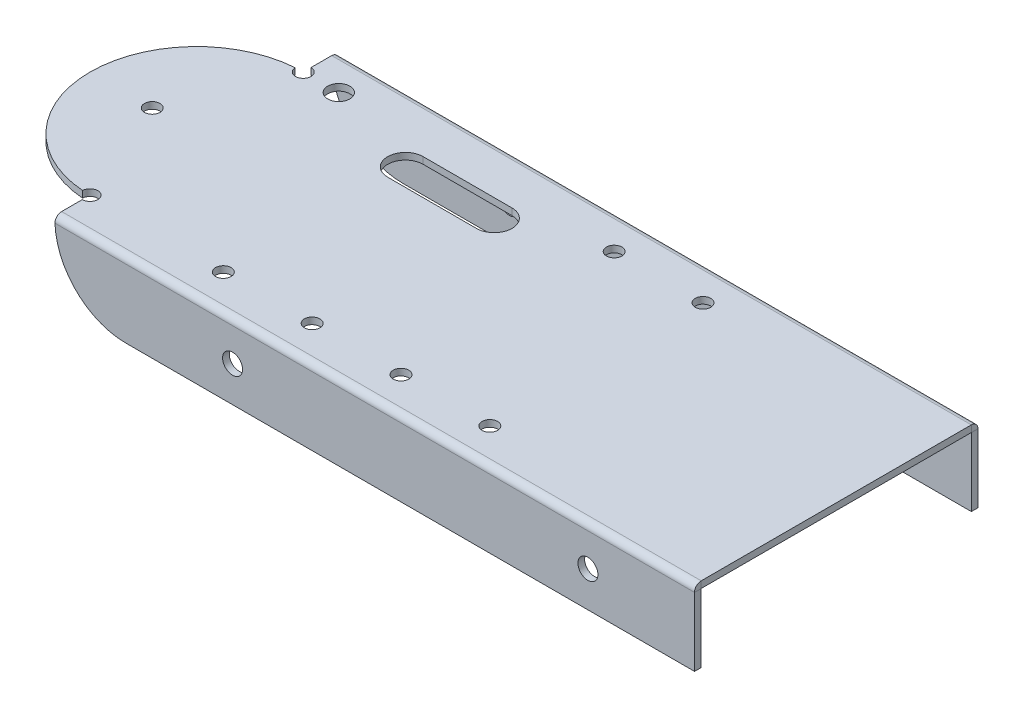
ISO-10303-21;
HEADER;
FILE_DESCRIPTION(('STEP AP214'),'2;1');
FILE_NAME('part.step','',(''),(''),'','','');
FILE_SCHEMA(('AUTOMOTIVE_DESIGN { 1 0 10303 214 1 1 1 1 }'));
ENDSEC;
DATA;
#1=APPLICATION_CONTEXT('core data for automotive mechanical design processes');
#2=APPLICATION_PROTOCOL_DEFINITION('international standard','automotive_design',2000,#1);
#3=PRODUCT_CONTEXT('',#1,'mechanical');
#4=PRODUCT('Part','Part','',(#3));
#5=PRODUCT_RELATED_PRODUCT_CATEGORY('part','',(#4));
#6=PRODUCT_DEFINITION_FORMATION('','',#4);
#7=PRODUCT_DEFINITION_CONTEXT('part definition',#1,'design');
#8=PRODUCT_DEFINITION('design','',#6,#7);
#9=PRODUCT_DEFINITION_SHAPE('','',#8);
#10=(LENGTH_UNIT() NAMED_UNIT(*) SI_UNIT(.MILLI.,.METRE.));
#11=(NAMED_UNIT(*) PLANE_ANGLE_UNIT() SI_UNIT($,.RADIAN.));
#12=(NAMED_UNIT(*) SI_UNIT($,.STERADIAN.) SOLID_ANGLE_UNIT());
#13=UNCERTAINTY_MEASURE_WITH_UNIT(LENGTH_MEASURE(1.E-05),#10,'distance_accuracy_value','');
#14=(GEOMETRIC_REPRESENTATION_CONTEXT(3) GLOBAL_UNCERTAINTY_ASSIGNED_CONTEXT((#13)) GLOBAL_UNIT_ASSIGNED_CONTEXT((#10,
#11,#12)) REPRESENTATION_CONTEXT('',''));
#15=CARTESIAN_POINT('',(0.,0.,0.));
#16=DIRECTION('',(0.,0.,1.));
#17=DIRECTION('',(1.,0.,0.));
#18=AXIS2_PLACEMENT_3D('',#15,#16,#17);
#19=CARTESIAN_POINT('',(40.,0.,31.));
#20=DIRECTION('',(0.,-1.,0.));
#21=DIRECTION('',(0.,0.,-1.));
#22=AXIS2_PLACEMENT_3D('',#19,#20,#21);
#23=PLANE('',#22);
#24=CARTESIAN_POINT('',(74.,0.,24.));
#25=DIRECTION('',(0.,1.,0.));
#26=DIRECTION('',(0.,0.,1.));
#27=AXIS2_PLACEMENT_3D('',#24,#25,#26);
#28=CIRCLE('',#27,1.75);
#29=CARTESIAN_POINT('',(74.,0.,25.75));
#30=VERTEX_POINT('',#29);
#31=EDGE_CURVE('E430',#30,#30,#28,.T.);
#32=ORIENTED_EDGE('',*,*,#31,.T.);
#33=EDGE_LOOP('',(#32));
#34=FACE_BOUND('',#33,.T.);
#35=CARTESIAN_POINT('',(14.,0.,0.));
#36=DIRECTION('',(0.,1.,0.));
#37=DIRECTION('',(0.,0.,1.));
#38=AXIS2_PLACEMENT_3D('',#35,#36,#37);
#39=CIRCLE('',#38,1.75);
#40=CARTESIAN_POINT('',(14.,0.,1.75));
#41=VERTEX_POINT('',#40);
#42=EDGE_CURVE('E442',#41,#41,#39,.T.);
#43=ORIENTED_EDGE('',*,*,#42,.T.);
#44=EDGE_LOOP('',(#43));
#45=FACE_BOUND('',#44,.T.);
#46=CARTESIAN_POINT('',(94.,0.,-24.));
#47=DIRECTION('',(0.,1.,0.));
#48=DIRECTION('',(0.,0.,1.));
#49=AXIS2_PLACEMENT_3D('',#46,#47,#48);
#50=CIRCLE('',#49,1.75);
#51=CARTESIAN_POINT('',(94.,0.,-22.25));
#52=VERTEX_POINT('',#51);
#53=EDGE_CURVE('E448',#52,#52,#50,.T.);
#54=ORIENTED_EDGE('',*,*,#53,.T.);
#55=EDGE_LOOP('',(#54));
#56=FACE_BOUND('',#55,.T.);
#57=CARTESIAN_POINT('',(94.,0.,24.));
#58=DIRECTION('',(0.,1.,0.));
#59=DIRECTION('',(0.,0.,-1.));
#60=AXIS2_PLACEMENT_3D('',#57,#58,#59);
#61=CIRCLE('',#60,1.75);
#62=CARTESIAN_POINT('',(94.,0.,22.25));
#63=VERTEX_POINT('',#62);
#64=EDGE_CURVE('E466',#63,#63,#61,.T.);
#65=ORIENTED_EDGE('',*,*,#64,.T.);
#66=EDGE_LOOP('',(#65));
#67=FACE_BOUND('',#66,.T.);
#68=DIRECTION('',(-1.,0.,0.));
#69=VECTOR('',#68,1.);
#70=CARTESIAN_POINT('',(54.,0.,-21.));
#71=LINE('',#70,#69);
#72=CARTESIAN_POINT('',(74.,0.,-21.));
#73=VERTEX_POINT('',#72);
#74=CARTESIAN_POINT('',(54.,0.,-21.));
#75=VERTEX_POINT('',#74);
#76=EDGE_CURVE('E481',#73,#75,#71,.T.);
#77=ORIENTED_EDGE('',*,*,#76,.T.);
#78=CARTESIAN_POINT('',(54.,0.,-17.));
#79=DIRECTION('',(0.,1.,0.));
#80=DIRECTION('',(0.,0.,1.));
#81=AXIS2_PLACEMENT_3D('',#78,#79,#80);
#82=CIRCLE('',#81,4.);
#83=CARTESIAN_POINT('',(54.,0.,-13.));
#84=VERTEX_POINT('',#83);
#85=EDGE_CURVE('E472',#75,#84,#82,.T.);
#86=ORIENTED_EDGE('',*,*,#85,.T.);
#87=DIRECTION('',(1.,0.,0.));
#88=VECTOR('',#87,1.);
#89=CARTESIAN_POINT('',(74.,0.,-13.));
#90=LINE('',#89,#88);
#91=CARTESIAN_POINT('',(74.,0.,-13.));
#92=VERTEX_POINT('',#91);
#93=EDGE_CURVE('E475',#84,#92,#90,.T.);
#94=ORIENTED_EDGE('',*,*,#93,.T.);
#95=CARTESIAN_POINT('',(74.,0.,-17.));
#96=DIRECTION('',(0.,1.,0.));
#97=DIRECTION('',(0.,0.,1.));
#98=AXIS2_PLACEMENT_3D('',#95,#96,#97);
#99=CIRCLE('',#98,4.);
#100=EDGE_CURVE('E478',#92,#73,#99,.T.);
#101=ORIENTED_EDGE('',*,*,#100,.T.);
#102=EDGE_LOOP('',(#77,#86,#94,#101));
#103=FACE_BOUND('',#102,.T.);
#104=CARTESIAN_POINT('',(114.,0.,24.));
#105=DIRECTION('',(0.,1.,0.));
#106=DIRECTION('',(0.,0.,-1.));
#107=AXIS2_PLACEMENT_3D('',#104,#105,#106);
#108=CIRCLE('',#107,1.75);
#109=CARTESIAN_POINT('',(114.,0.,22.25));
#110=VERTEX_POINT('',#109);
#111=EDGE_CURVE('E460',#110,#110,#108,.T.);
#112=ORIENTED_EDGE('',*,*,#111,.T.);
#113=EDGE_LOOP('',(#112));
#114=FACE_BOUND('',#113,.T.);
#115=CARTESIAN_POINT('',(114.,0.,-24.));
#116=DIRECTION('',(0.,1.,0.));
#117=DIRECTION('',(0.,0.,1.));
#118=AXIS2_PLACEMENT_3D('',#115,#116,#117);
#119=CIRCLE('',#118,1.75);
#120=CARTESIAN_POINT('',(114.,0.,-22.25));
#121=VERTEX_POINT('',#120);
#122=EDGE_CURVE('E454',#121,#121,#119,.T.);
#123=ORIENTED_EDGE('',*,*,#122,.T.);
#124=EDGE_LOOP('',(#123));
#125=FACE_BOUND('',#124,.T.);
#126=CARTESIAN_POINT('',(32.,0.,-24.));
#127=DIRECTION('',(0.,1.,0.));
#128=DIRECTION('',(0.,0.,1.));
#129=AXIS2_PLACEMENT_3D('',#126,#127,#128);
#130=CIRCLE('',#129,2.5);
#131=CARTESIAN_POINT('',(32.,0.,-21.5));
#132=VERTEX_POINT('',#131);
#133=EDGE_CURVE('E436',#132,#132,#130,.T.);
#134=ORIENTED_EDGE('',*,*,#133,.T.);
#135=EDGE_LOOP('',(#134));
#136=FACE_BOUND('',#135,.T.);
#137=CARTESIAN_POINT('',(54.,0.,24.));
#138=DIRECTION('',(0.,1.,0.));
#139=DIRECTION('',(0.,0.,1.));
#140=AXIS2_PLACEMENT_3D('',#137,#138,#139);
#141=CIRCLE('',#140,1.75);
#142=CARTESIAN_POINT('',(54.,0.,25.75));
#143=VERTEX_POINT('',#142);
#144=EDGE_CURVE('E418',#143,#143,#141,.T.);
#145=ORIENTED_EDGE('',*,*,#144,.T.);
#146=EDGE_LOOP('',(#145));
#147=FACE_BOUND('',#146,.T.);
#148=DIRECTION('',(0.,0.,-1.));
#149=VECTOR('',#148,1.);
#150=CARTESIAN_POINT('',(168.,0.,47.));
#151=LINE('',#150,#149);
#152=CARTESIAN_POINT('',(168.,0.,30.4030973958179));
#153=VERTEX_POINT('',#152);
#154=CARTESIAN_POINT('',(168.,2.1281956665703E-08,-30.4030973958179));
#155=VERTEX_POINT('',#154);
#156=EDGE_CURVE('E73',#153,#155,#151,.T.);
#157=ORIENTED_EDGE('',*,*,#156,.F.);
#158=DIRECTION('',(-1.,0.,0.));
#159=VECTOR('',#158,1.);
#160=CARTESIAN_POINT('',(40.,0.,30.4030973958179));
#161=LINE('',#160,#159);
#162=CARTESIAN_POINT('',(24.,0.,30.4030973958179));
#163=VERTEX_POINT('',#162);
#164=EDGE_CURVE('E65',#153,#163,#161,.T.);
#165=ORIENTED_EDGE('',*,*,#164,.T.);
#166=DIRECTION('',(0.,0.,1.));
#167=VECTOR('',#166,1.);
#168=CARTESIAN_POINT('',(24.,0.,31.));
#169=LINE('',#168,#167);
#170=CARTESIAN_POINT('',(24.,0.,25.75));
#171=VERTEX_POINT('',#170);
#172=EDGE_CURVE('E81',#171,#163,#169,.T.);
#173=ORIENTED_EDGE('',*,*,#172,.F.);
#174=CARTESIAN_POINT('',(24.,0.,24.));
#175=DIRECTION('',(0.,-1.,0.));
#176=DIRECTION('',(0.,0.,-1.));
#177=AXIS2_PLACEMENT_3D('',#174,#175,#176);
#178=CIRCLE('',#177,1.75000000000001);
#179=CARTESIAN_POINT('',(22.2511634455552,0.,23.9361979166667));
#180=VERTEX_POINT('',#179);
#181=EDGE_CURVE('E508',#180,#171,#178,.T.);
#182=ORIENTED_EDGE('',*,*,#181,.F.);
#183=CARTESIAN_POINT('',(24.,0.,0.));
#184=DIRECTION('',(0.,1.,0.));
#185=DIRECTION('',(0.,0.,1.));
#186=AXIS2_PLACEMENT_3D('',#183,#184,#185);
#187=CIRCLE('',#186,24.);
#188=CARTESIAN_POINT('',(22.2511634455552,0.,-23.9361979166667));
#189=VERTEX_POINT('',#188);
#190=EDGE_CURVE('E506',#189,#180,#187,.T.);
#191=ORIENTED_EDGE('',*,*,#190,.F.);
#192=CARTESIAN_POINT('',(24.,0.,-24.));
#193=DIRECTION('',(0.,-1.,0.));
#194=DIRECTION('',(0.,0.,1.));
#195=AXIS2_PLACEMENT_3D('',#192,#193,#194);
#196=CIRCLE('',#195,1.75000000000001);
#197=CARTESIAN_POINT('',(24.,0.,-25.75));
#198=VERTEX_POINT('',#197);
#199=EDGE_CURVE('E504',#198,#189,#196,.T.);
#200=ORIENTED_EDGE('',*,*,#199,.F.);
#201=DIRECTION('',(0.,0.,1.));
#202=VECTOR('',#201,1.);
#203=CARTESIAN_POINT('',(24.,0.,-31.));
#204=LINE('',#203,#202);
#205=CARTESIAN_POINT('',(24.,0.,-30.4030973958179));
#206=VERTEX_POINT('',#205);
#207=EDGE_CURVE('E503',#206,#198,#204,.T.);
#208=ORIENTED_EDGE('',*,*,#207,.F.);
#209=DIRECTION('',(-1.,0.,0.));
#210=VECTOR('',#209,1.);
#211=CARTESIAN_POINT('',(40.,0.,-30.4030973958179));
#212=LINE('',#211,#210);
#213=EDGE_CURVE('E536',#155,#206,#212,.T.);
#214=ORIENTED_EDGE('',*,*,#213,.F.);
#215=EDGE_LOOP('',(#157,#165,#173,#182,#191,#200,#208,#214));
#216=FACE_BOUND('',#215,.T.);
#217=ADVANCED_FACE('F56',(#34,#45,#56,#67,#103,#114,#125,#136,#147,#216),#23,.T.);
#218=CARTESIAN_POINT('',(168.,1.5,47.));
#219=DIRECTION('',(-1.,0.,0.));
#220=DIRECTION('',(0.,0.,1.));
#221=AXIS2_PLACEMENT_3D('',#218,#219,#220);
#222=PLANE('',#221);
#223=DIRECTION('',(0.,1.,0.));
#224=VECTOR('',#223,1.);
#225=CARTESIAN_POINT('',(168.,1.5,30.4030973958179));
#226=LINE('',#225,#224);
#227=CARTESIAN_POINT('',(168.,1.50000001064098,30.4030973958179));
#228=VERTEX_POINT('',#227);
#229=EDGE_CURVE('E12',#153,#228,#226,.T.);
#230=ORIENTED_EDGE('',*,*,#229,.F.);
#231=ORIENTED_EDGE('',*,*,#156,.T.);
#232=DIRECTION('',(0.,1.,0.));
#233=VECTOR('',#232,1.);
#234=CARTESIAN_POINT('',(168.,1.5,-30.4030973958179));
#235=LINE('',#234,#233);
#236=CARTESIAN_POINT('',(168.,1.50000001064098,-30.4030973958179));
#237=VERTEX_POINT('',#236);
#238=EDGE_CURVE('E533',#155,#237,#235,.T.);
#239=ORIENTED_EDGE('',*,*,#238,.T.);
#240=DIRECTION('',(0.,0.,-1.));
#241=VECTOR('',#240,1.);
#242=CARTESIAN_POINT('',(168.,1.5,47.));
#243=LINE('',#242,#241);
#244=EDGE_CURVE('E521',#228,#237,#243,.T.);
#245=ORIENTED_EDGE('',*,*,#244,.F.);
#246=EDGE_LOOP('',(#230,#231,#239,#245));
#247=FACE_BOUND('',#246,.T.);
#248=ADVANCED_FACE('F58',(#247),#222,.F.);
#249=CARTESIAN_POINT('',(24.,1.5,-31.));
#250=DIRECTION('',(1.,0.,0.));
#251=DIRECTION('',(0.,0.,-1.));
#252=AXIS2_PLACEMENT_3D('',#249,#250,#251);
#253=PLANE('',#252);
#254=DIRECTION('',(0.,0.,1.));
#255=VECTOR('',#254,1.);
#256=CARTESIAN_POINT('',(24.,1.5,-31.));
#257=LINE('',#256,#255);
#258=CARTESIAN_POINT('',(24.,1.50000001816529,-30.4030973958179));
#259=VERTEX_POINT('',#258);
#260=CARTESIAN_POINT('',(24.,1.5,-25.75));
#261=VERTEX_POINT('',#260);
#262=EDGE_CURVE('E513',#259,#261,#257,.T.);
#263=ORIENTED_EDGE('',*,*,#262,.F.);
#264=DIRECTION('',(0.,-1.,0.));
#265=VECTOR('',#264,1.);
#266=CARTESIAN_POINT('',(24.,1.5,-30.4030973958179));
#267=LINE('',#266,#265);
#268=EDGE_CURVE('E538',#259,#206,#267,.T.);
#269=ORIENTED_EDGE('',*,*,#268,.T.);
#270=ORIENTED_EDGE('',*,*,#207,.T.);
#271=DIRECTION('',(0.,-1.,0.));
#272=VECTOR('',#271,1.);
#273=CARTESIAN_POINT('',(24.,1.5,-25.75));
#274=LINE('',#273,#272);
#275=EDGE_CURVE('E527',#261,#198,#274,.T.);
#276=ORIENTED_EDGE('',*,*,#275,.F.);
#277=EDGE_LOOP('',(#263,#269,#270,#276));
#278=FACE_BOUND('',#277,.T.);
#279=ADVANCED_FACE('F612',(#278),#253,.F.);
#280=CARTESIAN_POINT('',(40.,1.5,31.));
#281=DIRECTION('',(0.,-1.,0.));
#282=DIRECTION('',(0.,0.,-1.));
#283=AXIS2_PLACEMENT_3D('',#280,#281,#282);
#284=PLANE('',#283);
#285=DIRECTION('',(-1.,0.,0.));
#286=VECTOR('',#285,1.);
#287=CARTESIAN_POINT('',(40.,1.5,30.4030973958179));
#288=LINE('',#287,#286);
#289=CARTESIAN_POINT('',(24.,1.5,30.4030973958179));
#290=VERTEX_POINT('',#289);
#291=EDGE_CURVE('E541',#228,#290,#288,.T.);
#292=ORIENTED_EDGE('',*,*,#291,.F.);
#293=ORIENTED_EDGE('',*,*,#244,.T.);
#294=DIRECTION('',(-1.,0.,0.));
#295=VECTOR('',#294,1.);
#296=CARTESIAN_POINT('',(40.,1.5,-30.4030973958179));
#297=LINE('',#296,#295);
#298=EDGE_CURVE('E530',#237,#259,#297,.T.);
#299=ORIENTED_EDGE('',*,*,#298,.T.);
#300=ORIENTED_EDGE('',*,*,#262,.T.);
#301=CARTESIAN_POINT('',(24.,1.5,-24.));
#302=DIRECTION('',(0.,-1.,0.));
#303=DIRECTION('',(0.,0.,1.));
#304=AXIS2_PLACEMENT_3D('',#301,#302,#303);
#305=CIRCLE('',#304,1.75000000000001);
#306=CARTESIAN_POINT('',(22.2511634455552,1.5,-23.9361979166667));
#307=VERTEX_POINT('',#306);
#308=EDGE_CURVE('E510',#261,#307,#305,.T.);
#309=ORIENTED_EDGE('',*,*,#308,.T.);
#310=CARTESIAN_POINT('',(24.,1.5,0.));
#311=DIRECTION('',(0.,1.,0.));
#312=DIRECTION('',(0.,0.,1.));
#313=AXIS2_PLACEMENT_3D('',#310,#311,#312);
#314=CIRCLE('',#313,24.);
#315=CARTESIAN_POINT('',(22.2511634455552,1.5,23.9361979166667));
#316=VERTEX_POINT('',#315);
#317=EDGE_CURVE('E512',#307,#316,#314,.T.);
#318=ORIENTED_EDGE('',*,*,#317,.T.);
#319=CARTESIAN_POINT('',(24.,1.5,24.));
#320=DIRECTION('',(0.,-1.,0.));
#321=DIRECTION('',(0.,0.,-1.));
#322=AXIS2_PLACEMENT_3D('',#319,#320,#321);
#323=CIRCLE('',#322,1.75000000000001);
#324=CARTESIAN_POINT('',(24.,1.5,25.75));
#325=VERTEX_POINT('',#324);
#326=EDGE_CURVE('E515',#316,#325,#323,.T.);
#327=ORIENTED_EDGE('',*,*,#326,.T.);
#328=DIRECTION('',(0.,0.,1.));
#329=VECTOR('',#328,1.);
#330=CARTESIAN_POINT('',(24.,1.5,31.));
#331=LINE('',#330,#329);
#332=EDGE_CURVE('E517',#325,#290,#331,.T.);
#333=ORIENTED_EDGE('',*,*,#332,.T.);
#334=EDGE_LOOP('',(#292,#293,#299,#300,#309,#318,#327,#333));
#335=FACE_BOUND('',#334,.T.);
#336=CARTESIAN_POINT('',(54.,1.5,24.));
#337=DIRECTION('',(0.,1.,0.));
#338=DIRECTION('',(0.,0.,1.));
#339=AXIS2_PLACEMENT_3D('',#336,#337,#338);
#340=CIRCLE('',#339,1.75);
#341=CARTESIAN_POINT('',(54.,1.5,25.75));
#342=VERTEX_POINT('',#341);
#343=EDGE_CURVE('E426',#342,#342,#340,.T.);
#344=ORIENTED_EDGE('',*,*,#343,.F.);
#345=EDGE_LOOP('',(#344));
#346=FACE_BOUND('',#345,.T.);
#347=CARTESIAN_POINT('',(32.,1.5,-24.));
#348=DIRECTION('',(0.,1.,0.));
#349=DIRECTION('',(0.,0.,1.));
#350=AXIS2_PLACEMENT_3D('',#347,#348,#349);
#351=CIRCLE('',#350,2.5);
#352=CARTESIAN_POINT('',(32.,1.5,-21.5));
#353=VERTEX_POINT('',#352);
#354=EDGE_CURVE('E439',#353,#353,#351,.T.);
#355=ORIENTED_EDGE('',*,*,#354,.F.);
#356=EDGE_LOOP('',(#355));
#357=FACE_BOUND('',#356,.T.);
#358=CARTESIAN_POINT('',(114.,1.5,-24.));
#359=DIRECTION('',(0.,1.,0.));
#360=DIRECTION('',(0.,0.,1.));
#361=AXIS2_PLACEMENT_3D('',#358,#359,#360);
#362=CIRCLE('',#361,1.75);
#363=CARTESIAN_POINT('',(114.,1.5,-22.25));
#364=VERTEX_POINT('',#363);
#365=EDGE_CURVE('E457',#364,#364,#362,.T.);
#366=ORIENTED_EDGE('',*,*,#365,.F.);
#367=EDGE_LOOP('',(#366));
#368=FACE_BOUND('',#367,.T.);
#369=CARTESIAN_POINT('',(114.,1.5,24.));
#370=DIRECTION('',(0.,1.,0.));
#371=DIRECTION('',(0.,0.,-1.));
#372=AXIS2_PLACEMENT_3D('',#369,#370,#371);
#373=CIRCLE('',#372,1.75);
#374=CARTESIAN_POINT('',(114.,1.5,22.25));
#375=VERTEX_POINT('',#374);
#376=EDGE_CURVE('E463',#375,#375,#373,.T.);
#377=ORIENTED_EDGE('',*,*,#376,.F.);
#378=EDGE_LOOP('',(#377));
#379=FACE_BOUND('',#378,.T.);
#380=CARTESIAN_POINT('',(54.,1.5,-17.));
#381=DIRECTION('',(0.,1.,0.));
#382=DIRECTION('',(0.,0.,1.));
#383=AXIS2_PLACEMENT_3D('',#380,#381,#382);
#384=CIRCLE('',#383,4.);
#385=CARTESIAN_POINT('',(54.,1.5,-21.));
#386=VERTEX_POINT('',#385);
#387=CARTESIAN_POINT('',(54.,1.5,-13.));
#388=VERTEX_POINT('',#387);
#389=EDGE_CURVE('E484',#386,#388,#384,.T.);
#390=ORIENTED_EDGE('',*,*,#389,.F.);
#391=DIRECTION('',(-1.,0.,0.));
#392=VECTOR('',#391,1.);
#393=CARTESIAN_POINT('',(54.,1.5,-21.));
#394=LINE('',#393,#392);
#395=CARTESIAN_POINT('',(74.,1.5,-21.));
#396=VERTEX_POINT('',#395);
#397=EDGE_CURVE('E491',#396,#386,#394,.T.);
#398=ORIENTED_EDGE('',*,*,#397,.F.);
#399=CARTESIAN_POINT('',(74.,1.5,-17.));
#400=DIRECTION('',(0.,1.,0.));
#401=DIRECTION('',(0.,0.,1.));
#402=AXIS2_PLACEMENT_3D('',#399,#400,#401);
#403=CIRCLE('',#402,4.);
#404=CARTESIAN_POINT('',(74.,1.5,-13.));
#405=VERTEX_POINT('',#404);
#406=EDGE_CURVE('E488',#405,#396,#403,.T.);
#407=ORIENTED_EDGE('',*,*,#406,.F.);
#408=DIRECTION('',(1.,0.,0.));
#409=VECTOR('',#408,1.);
#410=CARTESIAN_POINT('',(74.,1.5,-13.));
#411=LINE('',#410,#409);
#412=EDGE_CURVE('E486',#388,#405,#411,.T.);
#413=ORIENTED_EDGE('',*,*,#412,.F.);
#414=EDGE_LOOP('',(#390,#398,#407,#413));
#415=FACE_BOUND('',#414,.T.);
#416=CARTESIAN_POINT('',(94.,1.5,24.));
#417=DIRECTION('',(0.,1.,0.));
#418=DIRECTION('',(0.,0.,-1.));
#419=AXIS2_PLACEMENT_3D('',#416,#417,#418);
#420=CIRCLE('',#419,1.75);
#421=CARTESIAN_POINT('',(94.,1.5,22.25));
#422=VERTEX_POINT('',#421);
#423=EDGE_CURVE('E469',#422,#422,#420,.T.);
#424=ORIENTED_EDGE('',*,*,#423,.F.);
#425=EDGE_LOOP('',(#424));
#426=FACE_BOUND('',#425,.T.);
#427=CARTESIAN_POINT('',(94.,1.5,-24.));
#428=DIRECTION('',(0.,1.,0.));
#429=DIRECTION('',(0.,0.,1.));
#430=AXIS2_PLACEMENT_3D('',#427,#428,#429);
#431=CIRCLE('',#430,1.75);
#432=CARTESIAN_POINT('',(94.,1.5,-22.25));
#433=VERTEX_POINT('',#432);
#434=EDGE_CURVE('E451',#433,#433,#431,.T.);
#435=ORIENTED_EDGE('',*,*,#434,.F.);
#436=EDGE_LOOP('',(#435));
#437=FACE_BOUND('',#436,.T.);
#438=CARTESIAN_POINT('',(14.,1.5,0.));
#439=DIRECTION('',(0.,1.,0.));
#440=DIRECTION('',(0.,0.,1.));
#441=AXIS2_PLACEMENT_3D('',#438,#439,#440);
#442=CIRCLE('',#441,1.75);
#443=CARTESIAN_POINT('',(14.,1.5,1.75));
#444=VERTEX_POINT('',#443);
#445=EDGE_CURVE('E445',#444,#444,#442,.T.);
#446=ORIENTED_EDGE('',*,*,#445,.F.);
#447=EDGE_LOOP('',(#446));
#448=FACE_BOUND('',#447,.T.);
#449=CARTESIAN_POINT('',(74.,1.5,24.));
#450=DIRECTION('',(0.,1.,0.));
#451=DIRECTION('',(0.,0.,1.));
#452=AXIS2_PLACEMENT_3D('',#449,#450,#451);
#453=CIRCLE('',#452,1.75);
#454=CARTESIAN_POINT('',(74.,1.5,25.75));
#455=VERTEX_POINT('',#454);
#456=EDGE_CURVE('E433',#455,#455,#453,.T.);
#457=ORIENTED_EDGE('',*,*,#456,.F.);
#458=EDGE_LOOP('',(#457));
#459=FACE_BOUND('',#458,.T.);
#460=ADVANCED_FACE('F616',(#335,#346,#357,#368,#379,#415,#426,#437,#448,#459),#284,.F.);
#461=CARTESIAN_POINT('',(24.,1.5,-24.));
#462=DIRECTION('',(0.,-1.,0.));
#463=DIRECTION('',(0.,0.,-1.));
#464=AXIS2_PLACEMENT_3D('',#461,#462,#463);
#465=CYLINDRICAL_SURFACE('',#464,1.75000000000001);
#466=ORIENTED_EDGE('',*,*,#199,.T.);
#467=DIRECTION('',(0.,-1.,0.));
#468=VECTOR('',#467,1.);
#469=CARTESIAN_POINT('',(22.2511634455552,1.5,-23.9361979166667));
#470=LINE('',#469,#468);
#471=EDGE_CURVE('E524',#307,#189,#470,.T.);
#472=ORIENTED_EDGE('',*,*,#471,.F.);
#473=ORIENTED_EDGE('',*,*,#308,.F.);
#474=ORIENTED_EDGE('',*,*,#275,.T.);
#475=EDGE_LOOP('',(#466,#472,#473,#474));
#476=FACE_BOUND('',#475,.T.);
#477=ADVANCED_FACE('F619',(#476),#465,.F.);
#478=CARTESIAN_POINT('',(24.,1.5,0.));
#479=DIRECTION('',(0.,-1.,0.));
#480=DIRECTION('',(0.,0.,-1.));
#481=AXIS2_PLACEMENT_3D('',#478,#479,#480);
#482=CYLINDRICAL_SURFACE('',#481,24.);
#483=ORIENTED_EDGE('',*,*,#190,.T.);
#484=DIRECTION('',(0.,-1.,0.));
#485=VECTOR('',#484,1.);
#486=CARTESIAN_POINT('',(22.2511634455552,1.5,23.9361979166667));
#487=LINE('',#486,#485);
#488=EDGE_CURVE('E520',#316,#180,#487,.T.);
#489=ORIENTED_EDGE('',*,*,#488,.F.);
#490=ORIENTED_EDGE('',*,*,#317,.F.);
#491=ORIENTED_EDGE('',*,*,#471,.T.);
#492=EDGE_LOOP('',(#483,#489,#490,#491));
#493=FACE_BOUND('',#492,.T.);
#494=ADVANCED_FACE('F631',(#493),#482,.T.);
#495=CARTESIAN_POINT('',(24.,1.5,24.));
#496=DIRECTION('',(0.,-1.,0.));
#497=DIRECTION('',(0.,0.,-1.));
#498=AXIS2_PLACEMENT_3D('',#495,#496,#497);
#499=CYLINDRICAL_SURFACE('',#498,1.75000000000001);
#500=ORIENTED_EDGE('',*,*,#181,.T.);
#501=DIRECTION('',(0.,-1.,0.));
#502=VECTOR('',#501,1.);
#503=CARTESIAN_POINT('',(24.,1.5,25.75));
#504=LINE('',#503,#502);
#505=EDGE_CURVE('E518',#325,#171,#504,.T.);
#506=ORIENTED_EDGE('',*,*,#505,.F.);
#507=ORIENTED_EDGE('',*,*,#326,.F.);
#508=ORIENTED_EDGE('',*,*,#488,.T.);
#509=EDGE_LOOP('',(#500,#506,#507,#508));
#510=FACE_BOUND('',#509,.T.);
#511=ADVANCED_FACE('F625',(#510),#499,.F.);
#512=CARTESIAN_POINT('',(24.,1.5,31.));
#513=DIRECTION('',(1.,0.,0.));
#514=DIRECTION('',(0.,0.,-1.));
#515=AXIS2_PLACEMENT_3D('',#512,#513,#514);
#516=PLANE('',#515);
#517=DIRECTION('',(0.,-1.,0.));
#518=VECTOR('',#517,1.);
#519=CARTESIAN_POINT('',(24.,1.5,30.4030973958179));
#520=LINE('',#519,#518);
#521=EDGE_CURVE('E758',#290,#163,#520,.T.);
#522=ORIENTED_EDGE('',*,*,#521,.F.);
#523=ORIENTED_EDGE('',*,*,#332,.F.);
#524=ORIENTED_EDGE('',*,*,#505,.T.);
#525=ORIENTED_EDGE('',*,*,#172,.T.);
#526=EDGE_LOOP('',(#522,#523,#524,#525));
#527=FACE_BOUND('',#526,.T.);
#528=ADVANCED_FACE('F621',(#527),#516,.F.);
#529=CARTESIAN_POINT('',(54.,1.5,-17.));
#530=DIRECTION('',(0.,-1.,0.));
#531=DIRECTION('',(0.,0.,-1.));
#532=AXIS2_PLACEMENT_3D('',#529,#530,#531);
#533=CYLINDRICAL_SURFACE('',#532,4.);
#534=ORIENTED_EDGE('',*,*,#85,.F.);
#535=DIRECTION('',(0.,-1.,0.));
#536=VECTOR('',#535,1.);
#537=CARTESIAN_POINT('',(54.,1.5,-21.));
#538=LINE('',#537,#536);
#539=EDGE_CURVE('E493',#386,#75,#538,.T.);
#540=ORIENTED_EDGE('',*,*,#539,.F.);
#541=ORIENTED_EDGE('',*,*,#389,.T.);
#542=DIRECTION('',(0.,-1.,0.));
#543=VECTOR('',#542,1.);
#544=CARTESIAN_POINT('',(54.,1.5,-13.));
#545=LINE('',#544,#543);
#546=EDGE_CURVE('E500',#388,#84,#545,.T.);
#547=ORIENTED_EDGE('',*,*,#546,.T.);
#548=EDGE_LOOP('',(#534,#540,#541,#547));
#549=FACE_BOUND('',#548,.T.);
#550=ADVANCED_FACE('F624',(#549),#533,.F.);
#551=CARTESIAN_POINT('',(74.,1.5,-13.));
#552=DIRECTION('',(0.,0.,-1.));
#553=DIRECTION('',(-1.,0.,0.));
#554=AXIS2_PLACEMENT_3D('',#551,#552,#553);
#555=PLANE('',#554);
#556=ORIENTED_EDGE('',*,*,#93,.F.);
#557=ORIENTED_EDGE('',*,*,#546,.F.);
#558=ORIENTED_EDGE('',*,*,#412,.T.);
#559=DIRECTION('',(0.,-1.,0.));
#560=VECTOR('',#559,1.);
#561=CARTESIAN_POINT('',(74.,1.5,-13.));
#562=LINE('',#561,#560);
#563=EDGE_CURVE('E498',#405,#92,#562,.T.);
#564=ORIENTED_EDGE('',*,*,#563,.T.);
#565=EDGE_LOOP('',(#556,#557,#558,#564));
#566=FACE_BOUND('',#565,.T.);
#567=ADVANCED_FACE('F641',(#566),#555,.T.);
#568=CARTESIAN_POINT('',(74.,1.5,-17.));
#569=DIRECTION('',(0.,-1.,0.));
#570=DIRECTION('',(0.,0.,-1.));
#571=AXIS2_PLACEMENT_3D('',#568,#569,#570);
#572=CYLINDRICAL_SURFACE('',#571,4.);
#573=ORIENTED_EDGE('',*,*,#100,.F.);
#574=ORIENTED_EDGE('',*,*,#563,.F.);
#575=ORIENTED_EDGE('',*,*,#406,.T.);
#576=DIRECTION('',(0.,-1.,0.));
#577=VECTOR('',#576,1.);
#578=CARTESIAN_POINT('',(74.,1.5,-21.));
#579=LINE('',#578,#577);
#580=EDGE_CURVE('E496',#396,#73,#579,.T.);
#581=ORIENTED_EDGE('',*,*,#580,.T.);
#582=EDGE_LOOP('',(#573,#574,#575,#581));
#583=FACE_BOUND('',#582,.T.);
#584=ADVANCED_FACE('F645',(#583),#572,.F.);
#585=CARTESIAN_POINT('',(54.,1.5,-21.));
#586=DIRECTION('',(0.,0.,1.));
#587=DIRECTION('',(1.,0.,0.));
#588=AXIS2_PLACEMENT_3D('',#585,#586,#587);
#589=PLANE('',#588);
#590=ORIENTED_EDGE('',*,*,#76,.F.);
#591=ORIENTED_EDGE('',*,*,#580,.F.);
#592=ORIENTED_EDGE('',*,*,#397,.T.);
#593=ORIENTED_EDGE('',*,*,#539,.T.);
#594=EDGE_LOOP('',(#590,#591,#592,#593));
#595=FACE_BOUND('',#594,.T.);
#596=ADVANCED_FACE('F649',(#595),#589,.T.);
#597=CARTESIAN_POINT('',(94.,1.5,24.));
#598=DIRECTION('',(0.,-1.,0.));
#599=DIRECTION('',(0.,0.,-1.));
#600=AXIS2_PLACEMENT_3D('',#597,#598,#599);
#601=CYLINDRICAL_SURFACE('',#600,1.75);
#602=ORIENTED_EDGE('',*,*,#423,.T.);
#603=EDGE_LOOP('',(#602));
#604=FACE_BOUND('',#603,.T.);
#605=ORIENTED_EDGE('',*,*,#64,.F.);
#606=EDGE_LOOP('',(#605));
#607=FACE_BOUND('',#606,.T.);
#608=ADVANCED_FACE('F653',(#604,#607),#601,.F.);
#609=CARTESIAN_POINT('',(114.,1.5,24.));
#610=DIRECTION('',(0.,-1.,0.));
#611=DIRECTION('',(0.,0.,-1.));
#612=AXIS2_PLACEMENT_3D('',#609,#610,#611);
#613=CYLINDRICAL_SURFACE('',#612,1.75);
#614=ORIENTED_EDGE('',*,*,#376,.T.);
#615=EDGE_LOOP('',(#614));
#616=FACE_BOUND('',#615,.T.);
#617=ORIENTED_EDGE('',*,*,#111,.F.);
#618=EDGE_LOOP('',(#617));
#619=FACE_BOUND('',#618,.T.);
#620=ADVANCED_FACE('F657',(#616,#619),#613,.F.);
#621=CARTESIAN_POINT('',(114.,1.5,-24.));
#622=DIRECTION('',(0.,-1.,0.));
#623=DIRECTION('',(0.,0.,-1.));
#624=AXIS2_PLACEMENT_3D('',#621,#622,#623);
#625=CYLINDRICAL_SURFACE('',#624,1.75);
#626=ORIENTED_EDGE('',*,*,#365,.T.);
#627=EDGE_LOOP('',(#626));
#628=FACE_BOUND('',#627,.T.);
#629=ORIENTED_EDGE('',*,*,#122,.F.);
#630=EDGE_LOOP('',(#629));
#631=FACE_BOUND('',#630,.T.);
#632=ADVANCED_FACE('F661',(#628,#631),#625,.F.);
#633=CARTESIAN_POINT('',(94.,1.5,-24.));
#634=DIRECTION('',(0.,-1.,0.));
#635=DIRECTION('',(0.,0.,-1.));
#636=AXIS2_PLACEMENT_3D('',#633,#634,#635);
#637=CYLINDRICAL_SURFACE('',#636,1.75);
#638=ORIENTED_EDGE('',*,*,#434,.T.);
#639=EDGE_LOOP('',(#638));
#640=FACE_BOUND('',#639,.T.);
#641=ORIENTED_EDGE('',*,*,#53,.F.);
#642=EDGE_LOOP('',(#641));
#643=FACE_BOUND('',#642,.T.);
#644=ADVANCED_FACE('F665',(#640,#643),#637,.F.);
#645=CARTESIAN_POINT('',(14.,1.5,0.));
#646=DIRECTION('',(0.,-1.,0.));
#647=DIRECTION('',(0.,0.,-1.));
#648=AXIS2_PLACEMENT_3D('',#645,#646,#647);
#649=CYLINDRICAL_SURFACE('',#648,1.75);
#650=ORIENTED_EDGE('',*,*,#445,.T.);
#651=EDGE_LOOP('',(#650));
#652=FACE_BOUND('',#651,.T.);
#653=ORIENTED_EDGE('',*,*,#42,.F.);
#654=EDGE_LOOP('',(#653));
#655=FACE_BOUND('',#654,.T.);
#656=ADVANCED_FACE('F669',(#652,#655),#649,.F.);
#657=CARTESIAN_POINT('',(32.,1.5,-24.));
#658=DIRECTION('',(0.,-1.,0.));
#659=DIRECTION('',(0.,0.,-1.));
#660=AXIS2_PLACEMENT_3D('',#657,#658,#659);
#661=CYLINDRICAL_SURFACE('',#660,2.5);
#662=ORIENTED_EDGE('',*,*,#354,.T.);
#663=EDGE_LOOP('',(#662));
#664=FACE_BOUND('',#663,.T.);
#665=ORIENTED_EDGE('',*,*,#133,.F.);
#666=EDGE_LOOP('',(#665));
#667=FACE_BOUND('',#666,.T.);
#668=ADVANCED_FACE('F673',(#664,#667),#661,.F.);
#669=CARTESIAN_POINT('',(74.,1.5,24.));
#670=DIRECTION('',(0.,-1.,0.));
#671=DIRECTION('',(0.,0.,-1.));
#672=AXIS2_PLACEMENT_3D('',#669,#670,#671);
#673=CYLINDRICAL_SURFACE('',#672,1.75);
#674=ORIENTED_EDGE('',*,*,#456,.T.);
#675=EDGE_LOOP('',(#674));
#676=FACE_BOUND('',#675,.T.);
#677=ORIENTED_EDGE('',*,*,#31,.F.);
#678=EDGE_LOOP('',(#677));
#679=FACE_BOUND('',#678,.T.);
#680=ADVANCED_FACE('F677',(#676,#679),#673,.F.);
#681=CARTESIAN_POINT('',(54.,1.5,24.));
#682=DIRECTION('',(0.,-1.,0.));
#683=DIRECTION('',(0.,0.,-1.));
#684=AXIS2_PLACEMENT_3D('',#681,#682,#683);
#685=CYLINDRICAL_SURFACE('',#684,1.75);
#686=ORIENTED_EDGE('',*,*,#343,.T.);
#687=EDGE_LOOP('',(#686));
#688=FACE_BOUND('',#687,.T.);
#689=ORIENTED_EDGE('',*,*,#144,.F.);
#690=EDGE_LOOP('',(#689));
#691=FACE_BOUND('',#690,.T.);
#692=ADVANCED_FACE('F681',(#688,#691),#685,.F.);
#693=CARTESIAN_POINT('',(168.,-0.0100000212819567,-30.4030973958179));
#694=DIRECTION('',(1.,0.,0.));
#695=DIRECTION('',(0.,0.,-1.));
#696=AXIS2_PLACEMENT_3D('',#693,#694,#695);
#697=PLANE('',#696);
#698=ORIENTED_EDGE('',*,*,#238,.F.);
#699=CARTESIAN_POINT('',(168.,-0.01,-30.4030973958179));
#700=DIRECTION('',(-1.,0.,0.));
#701=DIRECTION('',(0.,0.,1.));
#702=AXIS2_PLACEMENT_3D('',#699,#700,#701);
#703=CIRCLE('',#702,0.0100000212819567);
#704=CARTESIAN_POINT('',(168.,-0.00999999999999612,-30.4130973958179));
#705=VERTEX_POINT('',#704);
#706=EDGE_CURVE('E354',#155,#705,#703,.T.);
#707=ORIENTED_EDGE('',*,*,#706,.T.);
#708=DIRECTION('',(0.,0.,-1.));
#709=VECTOR('',#708,1.);
#710=CARTESIAN_POINT('',(168.,-0.0100000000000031,-31.9130973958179));
#711=LINE('',#710,#709);
#712=CARTESIAN_POINT('',(168.,-0.0100000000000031,-31.9130973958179));
#713=VERTEX_POINT('',#712);
#714=EDGE_CURVE('E350',#705,#713,#711,.T.);
#715=ORIENTED_EDGE('',*,*,#714,.T.);
#716=CARTESIAN_POINT('',(168.,-0.0100000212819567,-30.4030973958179));
#717=DIRECTION('',(-1.,0.,0.));
#718=DIRECTION('',(0.,0.,1.));
#719=AXIS2_PLACEMENT_3D('',#716,#717,#718);
#720=CIRCLE('',#719,1.51000003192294);
#721=EDGE_CURVE('E358',#237,#713,#720,.T.);
#722=ORIENTED_EDGE('',*,*,#721,.F.);
#723=EDGE_LOOP('',(#698,#707,#715,#722));
#724=FACE_BOUND('',#723,.T.);
#725=ADVANCED_FACE('F684',(#724),#697,.T.);
#726=CARTESIAN_POINT('',(24.011138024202,-0.0100000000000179,-31.9130974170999));
#727=CARTESIAN_POINT('',(24.0092813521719,0.187694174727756,-31.9130974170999));
#728=CARTESIAN_POINT('',(24.007425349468,0.385239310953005,-31.8737961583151));
#729=CARTESIAN_POINT('',(24.003712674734,0.750464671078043,-31.7225148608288));
#730=CARTESIAN_POINT('',(24.0018566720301,0.917940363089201,-31.6106195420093));
#731=CARTESIAN_POINT('',(24.,1.05773125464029,-31.4708286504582));
#732=CARTESIAN_POINT('',(24.011138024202,-0.0100000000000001,-30.4130974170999));
#733=CARTESIAN_POINT('',(24.0092815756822,-0.00869092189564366,-30.4130974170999));
#734=CARTESIAN_POINT('',(24.007425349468,-0.00738251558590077,-30.4128371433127));
#735=CARTESIAN_POINT('',(24.003712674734,-0.00496379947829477,-30.4118352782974));
#736=CARTESIAN_POINT('',(24.0018564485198,-0.00385457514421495,-30.4110941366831));
#737=CARTESIAN_POINT('',(24.,-0.00292891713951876,-30.4101684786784));
#738=B_SPLINE_SURFACE_WITH_KNOTS('',1,3,((#726,#727,#728,#729,#730,#731),(#732,#733,#734,#735,
#736,#737)),.UNSPECIFIED.,.F.,.F.,.F.,(2,2),(4,2,4),(0.,1.),(0.,0.5,1.),.UNSPECIFIED.);
#739=CARTESIAN_POINT('',(24.011138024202,-0.0100000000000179,-31.9130974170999));
#740=CARTESIAN_POINT('',(24.011138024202,-0.0100000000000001,-30.4130974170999));
#741=B_SPLINE_CURVE_WITH_KNOTS('',1,(#739,#740),.UNSPECIFIED.,.F.,.F.,(2,2),(0.,1.),.UNSPECIFIED.);
#742=CARTESIAN_POINT('',(24.011138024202,-0.0100000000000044,-31.9130974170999));
#743=VERTEX_POINT('',#742);
#744=CARTESIAN_POINT('',(24.011138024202,-0.00999999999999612,-30.4130973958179));
#745=VERTEX_POINT('',#744);
#746=EDGE_CURVE('E353',#743,#745,#741,.T.);
#747=CARTESIAN_POINT('',(24.011138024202,-0.0100000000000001,-30.4130974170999));
#748=CARTESIAN_POINT('',(24.0092815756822,-0.00869092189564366,-30.4130974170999));
#749=CARTESIAN_POINT('',(24.007425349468,-0.00738251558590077,-30.4128371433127));
#750=CARTESIAN_POINT('',(24.003712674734,-0.00496379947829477,-30.4118352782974));
#751=CARTESIAN_POINT('',(24.0018564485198,-0.00385457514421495,-30.4110941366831));
#752=CARTESIAN_POINT('',(24.,-0.00292891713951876,-30.4101684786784));
#753=B_SPLINE_CURVE_WITH_KNOTS('',3,(#747,#748,#749,#750,#751,#752),.UNSPECIFIED.,.F.,.F.,(4,2,
4),(0.,0.5,1.),.UNSPECIFIED.);
#754=CARTESIAN_POINT('',(24.,-0.00292891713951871,-30.4101684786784));
#755=VERTEX_POINT('',#754);
#756=EDGE_CURVE('E357',#745,#755,#753,.T.);
#757=CARTESIAN_POINT('',(24.,-0.00292891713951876,-30.4101684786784));
#758=CARTESIAN_POINT('',(24.,1.05773125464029,-31.4708286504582));
#759=B_SPLINE_CURVE_WITH_KNOTS('',1,(#757,#758),.UNSPECIFIED.,.F.,.F.,(2,2),(0.,1.),.UNSPECIFIED.);
#760=CARTESIAN_POINT('',(24.,1.05773125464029,-31.4708286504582));
#761=VERTEX_POINT('',#760);
#762=EDGE_CURVE('E427',#755,#761,#759,.T.);
#763=CARTESIAN_POINT('',(24.,1.05773125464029,-31.4708286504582));
#764=CARTESIAN_POINT('',(24.0018566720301,0.917940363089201,-31.6106195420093));
#765=CARTESIAN_POINT('',(24.003712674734,0.750464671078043,-31.7225148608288));
#766=CARTESIAN_POINT('',(24.007425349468,0.385239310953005,-31.8737961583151));
#767=CARTESIAN_POINT('',(24.0092813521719,0.187694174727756,-31.9130974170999));
#768=CARTESIAN_POINT('',(24.011138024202,-0.0100000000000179,-31.9130974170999));
#769=B_SPLINE_CURVE_WITH_KNOTS('',3,(#763,#764,#765,#766,#767,#768),.UNSPECIFIED.,.F.,.F.,(4,2,
4),(0.,0.5,1.),.UNSPECIFIED.);
#770=EDGE_CURVE('E361',#743,#761,#769,.F.);
#771=ORIENTED_EDGE('',*,*,#746,.T.);
#772=ORIENTED_EDGE('',*,*,#756,.T.);
#773=ORIENTED_EDGE('',*,*,#762,.T.);
#774=ORIENTED_EDGE('',*,*,#770,.F.);
#775=EDGE_LOOP('',(#771,#772,#773,#774));
#776=FACE_BOUND('',#775,.T.);
#777=ADVANCED_FACE('F392',(#776),#738,.T.);
#778=CARTESIAN_POINT('',(24.,-0.0100000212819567,-30.4030973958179));
#779=DIRECTION('',(-1.,0.,0.));
#780=DIRECTION('',(0.,0.,1.));
#781=AXIS2_PLACEMENT_3D('',#778,#779,#780);
#782=PLANE('',#781);
#783=ORIENTED_EDGE('',*,*,#762,.F.);
#784=CARTESIAN_POINT('',(24.,-0.01,-30.4030973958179));
#785=DIRECTION('',(-1.,0.,0.));
#786=DIRECTION('',(0.,0.,1.));
#787=AXIS2_PLACEMENT_3D('',#784,#785,#786);
#788=CIRCLE('',#787,0.0100000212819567);
#789=EDGE_CURVE('E362',#755,#206,#788,.F.);
#790=ORIENTED_EDGE('',*,*,#789,.T.);
#791=ORIENTED_EDGE('',*,*,#268,.F.);
#792=CARTESIAN_POINT('',(24.,-0.0100000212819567,-30.4030973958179));
#793=DIRECTION('',(1.,0.,0.));
#794=DIRECTION('',(0.,0.,-1.));
#795=AXIS2_PLACEMENT_3D('',#792,#793,#794);
#796=CIRCLE('',#795,1.51000003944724);
#797=EDGE_CURVE('E371',#761,#259,#796,.T.);
#798=ORIENTED_EDGE('',*,*,#797,.F.);
#799=EDGE_LOOP('',(#783,#790,#791,#798));
#800=FACE_BOUND('',#799,.T.);
#801=ADVANCED_FACE('F385',(#800),#782,.T.);
#802=CARTESIAN_POINT('',(240.012760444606,-0.01,-30.4030973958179));
#803=DIRECTION('',(-1.,0.,0.));
#804=DIRECTION('',(0.,0.,1.));
#805=AXIS2_PLACEMENT_3D('',#802,#803,#804);
#806=CYLINDRICAL_SURFACE('',#805,1.51000002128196);
#807=ORIENTED_EDGE('',*,*,#797,.T.);
#808=ORIENTED_EDGE('',*,*,#298,.F.);
#809=ORIENTED_EDGE('',*,*,#721,.T.);
#810=DIRECTION('',(-1.,0.,0.));
#811=VECTOR('',#810,1.);
#812=CARTESIAN_POINT('',(40.,-0.0100000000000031,-31.9130973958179));
#813=LINE('',#812,#811);
#814=EDGE_CURVE('E548',#713,#743,#813,.T.);
#815=ORIENTED_EDGE('',*,*,#814,.T.);
#816=ORIENTED_EDGE('',*,*,#770,.T.);
#817=EDGE_LOOP('',(#807,#808,#809,#815,#816));
#818=FACE_BOUND('',#817,.T.);
#819=ADVANCED_FACE('F374',(#818),#806,.T.);
#820=CARTESIAN_POINT('',(240.012760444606,-0.01,-30.4030973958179));
#821=DIRECTION('',(-1.,0.,0.));
#822=DIRECTION('',(0.,0.,1.));
#823=AXIS2_PLACEMENT_3D('',#820,#821,#822);
#824=CYLINDRICAL_SURFACE('',#823,0.0100000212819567);
#825=ORIENTED_EDGE('',*,*,#789,.F.);
#826=ORIENTED_EDGE('',*,*,#756,.F.);
#827=DIRECTION('',(-1.,0.,0.));
#828=VECTOR('',#827,1.);
#829=CARTESIAN_POINT('',(40.,-0.00999999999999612,-30.4130973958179));
#830=LINE('',#829,#828);
#831=EDGE_CURVE('E323',#705,#745,#830,.T.);
#832=ORIENTED_EDGE('',*,*,#831,.F.);
#833=ORIENTED_EDGE('',*,*,#706,.F.);
#834=ORIENTED_EDGE('',*,*,#213,.T.);
#835=EDGE_LOOP('',(#825,#826,#832,#833,#834));
#836=FACE_BOUND('',#835,.T.);
#837=ADVANCED_FACE('F384',(#836),#824,.F.);
#838=CARTESIAN_POINT('',(64.,-7.41309739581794,-31.9130973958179));
#839=DIRECTION('',(0.,0.,1.));
#840=DIRECTION('',(0.,-1.,0.));
#841=AXIS2_PLACEMENT_3D('',#838,#839,#840);
#842=CYLINDRICAL_SURFACE('',#841,2.25);
#843=CARTESIAN_POINT('',(64.,-7.41309739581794,-31.9130973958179));
#844=DIRECTION('',(0.,0.,-1.));
#845=DIRECTION('',(0.,1.,0.));
#846=AXIS2_PLACEMENT_3D('',#843,#844,#845);
#847=CIRCLE('',#846,2.25);
#848=CARTESIAN_POINT('',(64.,-5.16309739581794,-31.9130973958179));
#849=VERTEX_POINT('',#848);
#850=EDGE_CURVE('E347',#849,#849,#847,.T.);
#851=ORIENTED_EDGE('',*,*,#850,.T.);
#852=EDGE_LOOP('',(#851));
#853=FACE_BOUND('',#852,.T.);
#854=CARTESIAN_POINT('',(64.,-7.41309739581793,-30.4130973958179));
#855=DIRECTION('',(0.,0.,-1.));
#856=DIRECTION('',(0.,1.,0.));
#857=AXIS2_PLACEMENT_3D('',#854,#855,#856);
#858=CIRCLE('',#857,2.25);
#859=CARTESIAN_POINT('',(64.,-5.16309739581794,-30.4130973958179));
#860=VERTEX_POINT('',#859);
#861=EDGE_CURVE('E324',#860,#860,#858,.T.);
#862=ORIENTED_EDGE('',*,*,#861,.F.);
#863=EDGE_LOOP('',(#862));
#864=FACE_BOUND('',#863,.T.);
#865=ADVANCED_FACE('F596',(#853,#864),#842,.F.);
#866=CARTESIAN_POINT('',(144.,-7.41309739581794,-31.9130973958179));
#867=DIRECTION('',(0.,0.,1.));
#868=DIRECTION('',(0.,-1.,0.));
#869=AXIS2_PLACEMENT_3D('',#866,#867,#868);
#870=CYLINDRICAL_SURFACE('',#869,2.25000000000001);
#871=CARTESIAN_POINT('',(144.,-7.41309739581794,-31.9130973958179));
#872=DIRECTION('',(0.,0.,-1.));
#873=DIRECTION('',(0.,1.,0.));
#874=AXIS2_PLACEMENT_3D('',#871,#872,#873);
#875=CIRCLE('',#874,2.25000000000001);
#876=CARTESIAN_POINT('',(144.,-5.16309739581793,-31.9130973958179));
#877=VERTEX_POINT('',#876);
#878=EDGE_CURVE('E344',#877,#877,#875,.T.);
#879=ORIENTED_EDGE('',*,*,#878,.T.);
#880=EDGE_LOOP('',(#879));
#881=FACE_BOUND('',#880,.T.);
#882=CARTESIAN_POINT('',(144.,-7.41309739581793,-30.4130973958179));
#883=DIRECTION('',(0.,0.,-1.));
#884=DIRECTION('',(0.,1.,0.));
#885=AXIS2_PLACEMENT_3D('',#882,#883,#884);
#886=CIRCLE('',#885,2.25000000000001);
#887=CARTESIAN_POINT('',(144.,-5.16309739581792,-30.4130973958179));
#888=VERTEX_POINT('',#887);
#889=EDGE_CURVE('E327',#888,#888,#886,.T.);
#890=ORIENTED_EDGE('',*,*,#889,.F.);
#891=EDGE_LOOP('',(#890));
#892=FACE_BOUND('',#891,.T.);
#893=ADVANCED_FACE('F592',(#881,#892),#870,.F.);
#894=CARTESIAN_POINT('',(40.,-15.4130973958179,-31.9130973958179));
#895=DIRECTION('',(0.,1.,0.));
#896=DIRECTION('',(1.,0.,0.));
#897=AXIS2_PLACEMENT_3D('',#894,#895,#896);
#898=PLANE('',#897);
#899=DIRECTION('',(-1.,0.,0.));
#900=VECTOR('',#899,1.);
#901=CARTESIAN_POINT('',(40.,-15.4130973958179,-30.4130973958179));
#902=LINE('',#901,#900);
#903=CARTESIAN_POINT('',(168.,-15.4130973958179,-30.4130973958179));
#904=VERTEX_POINT('',#903);
#905=CARTESIAN_POINT('',(40.,-15.4130973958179,-30.4130973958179));
#906=VERTEX_POINT('',#905);
#907=EDGE_CURVE('E341',#904,#906,#902,.T.);
#908=ORIENTED_EDGE('',*,*,#907,.T.);
#909=DIRECTION('',(0.,0.,1.));
#910=VECTOR('',#909,1.);
#911=CARTESIAN_POINT('',(40.,-15.4130973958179,-31.9130973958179));
#912=LINE('',#911,#910);
#913=CARTESIAN_POINT('',(40.,-15.4130973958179,-31.9130973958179));
#914=VERTEX_POINT('',#913);
#915=EDGE_CURVE('E314',#914,#906,#912,.T.);
#916=ORIENTED_EDGE('',*,*,#915,.F.);
#917=DIRECTION('',(-1.,0.,0.));
#918=VECTOR('',#917,1.);
#919=CARTESIAN_POINT('',(40.,-15.4130973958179,-31.9130973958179));
#920=LINE('',#919,#918);
#921=CARTESIAN_POINT('',(168.,-15.4130973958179,-31.9130973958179));
#922=VERTEX_POINT('',#921);
#923=EDGE_CURVE('E333',#922,#914,#920,.T.);
#924=ORIENTED_EDGE('',*,*,#923,.F.);
#925=DIRECTION('',(0.,0.,1.));
#926=VECTOR('',#925,1.);
#927=CARTESIAN_POINT('',(168.,-15.4130973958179,-31.9130973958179));
#928=LINE('',#927,#926);
#929=EDGE_CURVE('E338',#922,#904,#928,.T.);
#930=ORIENTED_EDGE('',*,*,#929,.T.);
#931=EDGE_LOOP('',(#908,#916,#924,#930));
#932=FACE_BOUND('',#931,.T.);
#933=ADVANCED_FACE('F588',(#932),#898,.F.);
#934=CARTESIAN_POINT('',(40.,62.5869026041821,-31.9130973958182));
#935=DIRECTION('',(0.,0.,1.));
#936=DIRECTION('',(0.,-1.,0.));
#937=AXIS2_PLACEMENT_3D('',#934,#935,#936);
#938=PLANE('',#937);
#939=ORIENTED_EDGE('',*,*,#814,.F.);
#940=DIRECTION('',(0.,-1.,0.));
#941=VECTOR('',#940,1.);
#942=CARTESIAN_POINT('',(168.,78.5869026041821,-31.9130973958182));
#943=LINE('',#942,#941);
#944=EDGE_CURVE('E336',#713,#922,#943,.T.);
#945=ORIENTED_EDGE('',*,*,#944,.T.);
#946=ORIENTED_EDGE('',*,*,#923,.T.);
#947=CARTESIAN_POINT('',(40.,0.586902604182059,-31.9130973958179));
#948=DIRECTION('',(0.,0.,-1.));
#949=DIRECTION('',(0.,1.,0.));
#950=AXIS2_PLACEMENT_3D('',#947,#948,#949);
#951=CIRCLE('',#950,16.);
#952=EDGE_CURVE('E332',#914,#743,#951,.T.);
#953=ORIENTED_EDGE('',*,*,#952,.T.);
#954=EDGE_LOOP('',(#939,#945,#946,#953));
#955=FACE_BOUND('',#954,.T.);
#956=ORIENTED_EDGE('',*,*,#878,.F.);
#957=EDGE_LOOP('',(#956));
#958=FACE_BOUND('',#957,.T.);
#959=ORIENTED_EDGE('',*,*,#850,.F.);
#960=EDGE_LOOP('',(#959));
#961=FACE_BOUND('',#960,.T.);
#962=ADVANCED_FACE('F584',(#955,#958,#961),#938,.F.);
#963=CARTESIAN_POINT('',(168.,78.5869026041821,-31.9130973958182));
#964=DIRECTION('',(-1.,0.,0.));
#965=DIRECTION('',(0.,1.,0.));
#966=AXIS2_PLACEMENT_3D('',#963,#964,#965);
#967=PLANE('',#966);
#968=ORIENTED_EDGE('',*,*,#714,.F.);
#969=DIRECTION('',(0.,-1.,0.));
#970=VECTOR('',#969,1.);
#971=CARTESIAN_POINT('',(168.,78.5869026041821,-30.4130973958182));
#972=LINE('',#971,#970);
#973=EDGE_CURVE('E330',#705,#904,#972,.T.);
#974=ORIENTED_EDGE('',*,*,#973,.T.);
#975=ORIENTED_EDGE('',*,*,#929,.F.);
#976=ORIENTED_EDGE('',*,*,#944,.F.);
#977=EDGE_LOOP('',(#968,#974,#975,#976));
#978=FACE_BOUND('',#977,.T.);
#979=ADVANCED_FACE('F580',(#978),#967,.F.);
#980=CARTESIAN_POINT('',(40.,62.5869026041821,-30.4130973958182));
#981=DIRECTION('',(0.,0.,1.));
#982=DIRECTION('',(0.,-1.,0.));
#983=AXIS2_PLACEMENT_3D('',#980,#981,#982);
#984=PLANE('',#983);
#985=ORIENTED_EDGE('',*,*,#889,.T.);
#986=EDGE_LOOP('',(#985));
#987=FACE_BOUND('',#986,.T.);
#988=ORIENTED_EDGE('',*,*,#861,.T.);
#989=EDGE_LOOP('',(#988));
#990=FACE_BOUND('',#989,.T.);
#991=ORIENTED_EDGE('',*,*,#973,.F.);
#992=ORIENTED_EDGE('',*,*,#831,.T.);
#993=CARTESIAN_POINT('',(40.,0.586902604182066,-30.4130973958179));
#994=DIRECTION('',(0.,0.,-1.));
#995=DIRECTION('',(0.,1.,0.));
#996=AXIS2_PLACEMENT_3D('',#993,#994,#995);
#997=CIRCLE('',#996,16.);
#998=EDGE_CURVE('E322',#906,#745,#997,.T.);
#999=ORIENTED_EDGE('',*,*,#998,.F.);
#1000=ORIENTED_EDGE('',*,*,#907,.F.);
#1001=EDGE_LOOP('',(#991,#992,#999,#1000));
#1002=FACE_BOUND('',#1001,.T.);
#1003=ADVANCED_FACE('F577',(#987,#990,#1002),#984,.T.);
#1004=CARTESIAN_POINT('',(40.,0.586902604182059,-31.9130973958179));
#1005=DIRECTION('',(0.,0.,1.));
#1006=DIRECTION('',(0.,-1.,0.));
#1007=AXIS2_PLACEMENT_3D('',#1004,#1005,#1006);
#1008=CYLINDRICAL_SURFACE('',#1007,16.);
#1009=ORIENTED_EDGE('',*,*,#746,.F.);
#1010=ORIENTED_EDGE('',*,*,#952,.F.);
#1011=ORIENTED_EDGE('',*,*,#915,.T.);
#1012=ORIENTED_EDGE('',*,*,#998,.T.);
#1013=EDGE_LOOP('',(#1009,#1010,#1011,#1012));
#1014=FACE_BOUND('',#1013,.T.);
#1015=ADVANCED_FACE('F567',(#1014),#1008,.T.);
#1016=CARTESIAN_POINT('',(168.,-0.0100000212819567,30.4030973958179));
#1017=DIRECTION('',(1.,0.,0.));
#1018=DIRECTION('',(0.,0.,-1.));
#1019=AXIS2_PLACEMENT_3D('',#1016,#1017,#1018);
#1020=PLANE('',#1019);
#1021=DIRECTION('',(0.,0.,1.));
#1022=VECTOR('',#1021,1.);
#1023=CARTESIAN_POINT('',(168.,-0.0100000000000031,31.9130973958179));
#1024=LINE('',#1023,#1022);
#1025=CARTESIAN_POINT('',(168.,-0.00999999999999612,30.4130973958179));
#1026=VERTEX_POINT('',#1025);
#1027=CARTESIAN_POINT('',(168.,-0.0100000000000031,31.9130973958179));
#1028=VERTEX_POINT('',#1027);
#1029=EDGE_CURVE('E746',#1026,#1028,#1024,.T.);
#1030=ORIENTED_EDGE('',*,*,#1029,.F.);
#1031=CARTESIAN_POINT('',(168.,-0.01,30.4030973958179));
#1032=DIRECTION('',(1.,0.,0.));
#1033=DIRECTION('',(0.,0.,-1.));
#1034=AXIS2_PLACEMENT_3D('',#1031,#1032,#1033);
#1035=CIRCLE('',#1034,0.0100000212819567);
#1036=EDGE_CURVE('E241',#1026,#153,#1035,.F.);
#1037=ORIENTED_EDGE('',*,*,#1036,.T.);
#1038=ORIENTED_EDGE('',*,*,#229,.T.);
#1039=CARTESIAN_POINT('',(168.,-0.0100000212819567,30.4030973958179));
#1040=DIRECTION('',(-1.,0.,0.));
#1041=DIRECTION('',(0.,0.,1.));
#1042=AXIS2_PLACEMENT_3D('',#1039,#1040,#1041);
#1043=CIRCLE('',#1042,1.51000003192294);
#1044=EDGE_CURVE('E246',#1028,#228,#1043,.T.);
#1045=ORIENTED_EDGE('',*,*,#1044,.F.);
#1046=EDGE_LOOP('',(#1030,#1037,#1038,#1045));
#1047=FACE_BOUND('',#1046,.T.);
#1048=ADVANCED_FACE('F576',(#1047),#1020,.T.);
#1049=CARTESIAN_POINT('',(24.,-0.0100000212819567,30.4030973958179));
#1050=DIRECTION('',(-1.,0.,0.));
#1051=DIRECTION('',(0.,0.,1.));
#1052=AXIS2_PLACEMENT_3D('',#1049,#1050,#1051);
#1053=PLANE('',#1052);
#1054=ORIENTED_EDGE('',*,*,#521,.T.);
#1055=CARTESIAN_POINT('',(24.,-0.01,30.4030973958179));
#1056=DIRECTION('',(1.,0.,0.));
#1057=DIRECTION('',(0.,0.,-1.));
#1058=AXIS2_PLACEMENT_3D('',#1055,#1056,#1057);
#1059=CIRCLE('',#1058,0.0100000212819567);
#1060=CARTESIAN_POINT('',(24.,-0.00292891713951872,30.4101684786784));
#1061=VERTEX_POINT('',#1060);
#1062=EDGE_CURVE('E244',#163,#1061,#1059,.T.);
#1063=ORIENTED_EDGE('',*,*,#1062,.T.);
#1064=CARTESIAN_POINT('',(24.,1.05773125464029,31.4708286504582));
#1065=CARTESIAN_POINT('',(24.,-0.00292891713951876,30.4101684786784));
#1066=B_SPLINE_CURVE_WITH_KNOTS('',1,(#1064,#1065),.UNSPECIFIED.,.F.,.F.,(2,2),(0.,1.),.UNSPECIFIED.);
#1067=CARTESIAN_POINT('',(24.,1.05773125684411,31.4708286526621));
#1068=VERTEX_POINT('',#1067);
#1069=EDGE_CURVE('E551',#1061,#1068,#1066,.F.);
#1070=ORIENTED_EDGE('',*,*,#1069,.T.);
#1071=CARTESIAN_POINT('',(24.,-0.0100000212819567,30.4030973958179));
#1072=DIRECTION('',(1.,0.,0.));
#1073=DIRECTION('',(0.,0.,-1.));
#1074=AXIS2_PLACEMENT_3D('',#1071,#1072,#1073);
#1075=CIRCLE('',#1074,1.51000003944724);
#1076=EDGE_CURVE('E249',#290,#1068,#1075,.T.);
#1077=ORIENTED_EDGE('',*,*,#1076,.F.);
#1078=EDGE_LOOP('',(#1054,#1063,#1070,#1077));
#1079=FACE_BOUND('',#1078,.T.);
#1080=ADVANCED_FACE('F277',(#1079),#1053,.T.);
#1081=CARTESIAN_POINT('',(24.,1.05773125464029,31.4708286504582));
#1082=CARTESIAN_POINT('',(24.00185667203,0.917940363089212,31.6106195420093));
#1083=CARTESIAN_POINT('',(24.003712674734,0.750464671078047,31.7225148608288));
#1084=CARTESIAN_POINT('',(24.007425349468,0.385239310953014,31.8737961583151));
#1085=CARTESIAN_POINT('',(24.0092813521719,0.187694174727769,31.9130974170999));
#1086=CARTESIAN_POINT('',(24.0111380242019,-0.0100000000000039,31.9130974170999));
#1087=CARTESIAN_POINT('',(24.,-0.00292891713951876,30.4101684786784));
#1088=CARTESIAN_POINT('',(24.0018564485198,-0.00385457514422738,30.4110941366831));
#1089=CARTESIAN_POINT('',(24.003712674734,-0.00496379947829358,30.4118352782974));
#1090=CARTESIAN_POINT('',(24.007425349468,-0.00738251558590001,30.4128371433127));
#1091=CARTESIAN_POINT('',(24.0092815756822,-0.00869092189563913,30.4130974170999));
#1092=CARTESIAN_POINT('',(24.0111380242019,-0.0100000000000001,30.4130974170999));
#1093=B_SPLINE_SURFACE_WITH_KNOTS('',1,3,((#1081,#1082,#1083,#1084,#1085,#1086),(#1087,#1088,
#1089,#1090,#1091,#1092)),.UNSPECIFIED.,.F.,.F.,.F.,(2,2),(4,2,4),(0.,1.),(0.,0.5,1.),.UNSPECIFIED.);
#1094=CARTESIAN_POINT('',(24.,-0.00292891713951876,30.4101684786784));
#1095=CARTESIAN_POINT('',(24.0018564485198,-0.00385457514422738,30.4110941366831));
#1096=CARTESIAN_POINT('',(24.003712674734,-0.00496379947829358,30.4118352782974));
#1097=CARTESIAN_POINT('',(24.007425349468,-0.00738251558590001,30.4128371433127));
#1098=CARTESIAN_POINT('',(24.0092815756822,-0.00869092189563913,30.4130974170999));
#1099=CARTESIAN_POINT('',(24.0111380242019,-0.0100000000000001,30.4130974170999));
#1100=B_SPLINE_CURVE_WITH_KNOTS('',3,(#1094,#1095,#1096,#1097,#1098,#1099),.UNSPECIFIED.,.F.,
.F.,(4,2,4),(0.,0.5,1.),.UNSPECIFIED.);
#1101=CARTESIAN_POINT('',(24.0111380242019,-0.00999999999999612,30.4130973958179));
#1102=VERTEX_POINT('',#1101);
#1103=EDGE_CURVE('E250',#1061,#1102,#1100,.T.);
#1104=CARTESIAN_POINT('',(24.0111380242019,-0.0100000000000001,30.4130974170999));
#1105=CARTESIAN_POINT('',(24.0111380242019,-0.0100000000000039,31.9130974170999));
#1106=B_SPLINE_CURVE_WITH_KNOTS('',1,(#1104,#1105),.UNSPECIFIED.,.F.,.F.,(2,2),(0.,1.),.UNSPECIFIED.);
#1107=CARTESIAN_POINT('',(24.0111380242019,-0.0100000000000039,31.9130974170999));
#1108=VERTEX_POINT('',#1107);
#1109=EDGE_CURVE('E216',#1108,#1102,#1106,.F.);
#1110=CARTESIAN_POINT('',(24.0111380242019,-0.0100000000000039,31.9130974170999));
#1111=CARTESIAN_POINT('',(24.0092813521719,0.187694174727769,31.9130974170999));
#1112=CARTESIAN_POINT('',(24.007425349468,0.385239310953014,31.8737961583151));
#1113=CARTESIAN_POINT('',(24.003712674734,0.750464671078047,31.7225148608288));
#1114=CARTESIAN_POINT('',(24.00185667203,0.917940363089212,31.6106195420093));
#1115=CARTESIAN_POINT('',(24.,1.05773125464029,31.4708286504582));
#1116=B_SPLINE_CURVE_WITH_KNOTS('',3,(#1110,#1111,#1112,#1113,#1114,#1115),.UNSPECIFIED.,.F.,
.F.,(4,2,4),(0.,0.5,1.),.UNSPECIFIED.);
#1117=EDGE_CURVE('E763',#1068,#1108,#1116,.F.);
#1118=ORIENTED_EDGE('',*,*,#1069,.F.);
#1119=ORIENTED_EDGE('',*,*,#1103,.T.);
#1120=ORIENTED_EDGE('',*,*,#1109,.F.);
#1121=ORIENTED_EDGE('',*,*,#1117,.F.);
#1122=EDGE_LOOP('',(#1118,#1119,#1120,#1121));
#1123=FACE_BOUND('',#1122,.T.);
#1124=ADVANCED_FACE('F268',(#1123),#1093,.T.);
#1125=CARTESIAN_POINT('',(-48.0127604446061,-0.01,30.4030973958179));
#1126=DIRECTION('',(1.,0.,0.));
#1127=DIRECTION('',(0.,0.,-1.));
#1128=AXIS2_PLACEMENT_3D('',#1125,#1126,#1127);
#1129=CYLINDRICAL_SURFACE('',#1128,1.51000002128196);
#1130=ORIENTED_EDGE('',*,*,#1117,.T.);
#1131=DIRECTION('',(-1.,0.,0.));
#1132=VECTOR('',#1131,1.);
#1133=CARTESIAN_POINT('',(40.,-0.0100000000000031,31.9130973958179));
#1134=LINE('',#1133,#1132);
#1135=EDGE_CURVE('E715',#1028,#1108,#1134,.T.);
#1136=ORIENTED_EDGE('',*,*,#1135,.F.);
#1137=ORIENTED_EDGE('',*,*,#1044,.T.);
#1138=ORIENTED_EDGE('',*,*,#291,.T.);
#1139=ORIENTED_EDGE('',*,*,#1076,.T.);
#1140=EDGE_LOOP('',(#1130,#1136,#1137,#1138,#1139));
#1141=FACE_BOUND('',#1140,.T.);
#1142=ADVANCED_FACE('F257',(#1141),#1129,.T.);
#1143=CARTESIAN_POINT('',(-48.0127604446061,-0.01,30.4030973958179));
#1144=DIRECTION('',(1.,0.,0.));
#1145=DIRECTION('',(0.,0.,-1.));
#1146=AXIS2_PLACEMENT_3D('',#1143,#1144,#1145);
#1147=CYLINDRICAL_SURFACE('',#1146,0.0100000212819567);
#1148=ORIENTED_EDGE('',*,*,#1103,.F.);
#1149=ORIENTED_EDGE('',*,*,#1062,.F.);
#1150=ORIENTED_EDGE('',*,*,#164,.F.);
#1151=ORIENTED_EDGE('',*,*,#1036,.F.);
#1152=DIRECTION('',(-1.,0.,0.));
#1153=VECTOR('',#1152,1.);
#1154=CARTESIAN_POINT('',(40.,-0.00999999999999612,30.4130973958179));
#1155=LINE('',#1154,#1153);
#1156=EDGE_CURVE('E235',#1026,#1102,#1155,.T.);
#1157=ORIENTED_EDGE('',*,*,#1156,.T.);
#1158=EDGE_LOOP('',(#1148,#1149,#1150,#1151,#1157));
#1159=FACE_BOUND('',#1158,.T.);
#1160=ADVANCED_FACE('F267',(#1159),#1147,.F.);
#1161=CARTESIAN_POINT('',(40.,-15.4130973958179,31.9130973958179));
#1162=DIRECTION('',(0.,1.,0.));
#1163=DIRECTION('',(-1.,0.,0.));
#1164=AXIS2_PLACEMENT_3D('',#1161,#1162,#1163);
#1165=PLANE('',#1164);
#1166=DIRECTION('',(1.,0.,0.));
#1167=VECTOR('',#1166,1.);
#1168=CARTESIAN_POINT('',(40.,-15.4130973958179,30.4130973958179));
#1169=LINE('',#1168,#1167);
#1170=CARTESIAN_POINT('',(40.,-15.4130973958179,30.4130973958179));
#1171=VERTEX_POINT('',#1170);
#1172=CARTESIAN_POINT('',(168.,-15.4130973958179,30.4130973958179));
#1173=VERTEX_POINT('',#1172);
#1174=EDGE_CURVE('E226',#1171,#1173,#1169,.T.);
#1175=ORIENTED_EDGE('',*,*,#1174,.T.);
#1176=DIRECTION('',(0.,0.,-1.));
#1177=VECTOR('',#1176,1.);
#1178=CARTESIAN_POINT('',(168.,-15.4130973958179,31.9130973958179));
#1179=LINE('',#1178,#1177);
#1180=CARTESIAN_POINT('',(168.,-15.4130973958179,31.9130973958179));
#1181=VERTEX_POINT('',#1180);
#1182=EDGE_CURVE('E245',#1181,#1173,#1179,.T.);
#1183=ORIENTED_EDGE('',*,*,#1182,.F.);
#1184=DIRECTION('',(1.,0.,0.));
#1185=VECTOR('',#1184,1.);
#1186=CARTESIAN_POINT('',(40.,-15.4130973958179,31.9130973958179));
#1187=LINE('',#1186,#1185);
#1188=CARTESIAN_POINT('',(40.,-15.4130973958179,31.9130973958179));
#1189=VERTEX_POINT('',#1188);
#1190=EDGE_CURVE('E228',#1189,#1181,#1187,.T.);
#1191=ORIENTED_EDGE('',*,*,#1190,.F.);
#1192=DIRECTION('',(0.,0.,-1.));
#1193=VECTOR('',#1192,1.);
#1194=CARTESIAN_POINT('',(40.,-15.4130973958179,31.9130973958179));
#1195=LINE('',#1194,#1193);
#1196=EDGE_CURVE('E213',#1189,#1171,#1195,.T.);
#1197=ORIENTED_EDGE('',*,*,#1196,.T.);
#1198=EDGE_LOOP('',(#1175,#1183,#1191,#1197));
#1199=FACE_BOUND('',#1198,.T.);
#1200=ADVANCED_FACE('F224',(#1199),#1165,.F.);
#1201=CARTESIAN_POINT('',(64.,-7.41309739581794,31.9130973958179));
#1202=DIRECTION('',(0.,0.,-1.));
#1203=DIRECTION('',(0.,1.,0.));
#1204=AXIS2_PLACEMENT_3D('',#1201,#1202,#1203);
#1205=CYLINDRICAL_SURFACE('',#1204,2.25);
#1206=CARTESIAN_POINT('',(64.,-7.41309739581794,31.9130973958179));
#1207=DIRECTION('',(0.,0.,1.));
#1208=DIRECTION('',(0.,1.,0.));
#1209=AXIS2_PLACEMENT_3D('',#1206,#1207,#1208);
#1210=CIRCLE('',#1209,2.25);
#1211=CARTESIAN_POINT('',(64.,-5.16309739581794,31.9130973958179));
#1212=VERTEX_POINT('',#1211);
#1213=EDGE_CURVE('E229',#1212,#1212,#1210,.T.);
#1214=ORIENTED_EDGE('',*,*,#1213,.T.);
#1215=EDGE_LOOP('',(#1214));
#1216=FACE_BOUND('',#1215,.T.);
#1217=CARTESIAN_POINT('',(64.,-7.41309739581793,30.4130973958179));
#1218=DIRECTION('',(0.,0.,1.));
#1219=DIRECTION('',(0.,1.,0.));
#1220=AXIS2_PLACEMENT_3D('',#1217,#1218,#1219);
#1221=CIRCLE('',#1220,2.25);
#1222=CARTESIAN_POINT('',(64.,-5.16309739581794,30.4130973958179));
#1223=VERTEX_POINT('',#1222);
#1224=EDGE_CURVE('E748',#1223,#1223,#1221,.T.);
#1225=ORIENTED_EDGE('',*,*,#1224,.F.);
#1226=EDGE_LOOP('',(#1225));
#1227=FACE_BOUND('',#1226,.T.);
#1228=ADVANCED_FACE('F789',(#1216,#1227),#1205,.F.);
#1229=CARTESIAN_POINT('',(144.,-7.41309739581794,31.9130973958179));
#1230=DIRECTION('',(0.,0.,-1.));
#1231=DIRECTION('',(0.,1.,0.));
#1232=AXIS2_PLACEMENT_3D('',#1229,#1230,#1231);
#1233=CYLINDRICAL_SURFACE('',#1232,2.25000000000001);
#1234=CARTESIAN_POINT('',(144.,-7.41309739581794,31.9130973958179));
#1235=DIRECTION('',(0.,0.,1.));
#1236=DIRECTION('',(0.,1.,0.));
#1237=AXIS2_PLACEMENT_3D('',#1234,#1235,#1236);
#1238=CIRCLE('',#1237,2.25000000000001);
#1239=CARTESIAN_POINT('',(144.,-5.16309739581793,31.9130973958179));
#1240=VERTEX_POINT('',#1239);
#1241=EDGE_CURVE('E780',#1240,#1240,#1238,.T.);
#1242=ORIENTED_EDGE('',*,*,#1241,.T.);
#1243=EDGE_LOOP('',(#1242));
#1244=FACE_BOUND('',#1243,.T.);
#1245=CARTESIAN_POINT('',(144.,-7.41309739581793,30.4130973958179));
#1246=DIRECTION('',(0.,0.,1.));
#1247=DIRECTION('',(0.,1.,0.));
#1248=AXIS2_PLACEMENT_3D('',#1245,#1246,#1247);
#1249=CIRCLE('',#1248,2.25000000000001);
#1250=CARTESIAN_POINT('',(144.,-5.16309739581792,30.4130973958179));
#1251=VERTEX_POINT('',#1250);
#1252=EDGE_CURVE('E222',#1251,#1251,#1249,.T.);
#1253=ORIENTED_EDGE('',*,*,#1252,.F.);
#1254=EDGE_LOOP('',(#1253));
#1255=FACE_BOUND('',#1254,.T.);
#1256=ADVANCED_FACE('F793',(#1244,#1255),#1233,.F.);
#1257=CARTESIAN_POINT('',(40.,0.586902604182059,31.9130973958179));
#1258=DIRECTION('',(0.,0.,-1.));
#1259=DIRECTION('',(0.,1.,0.));
#1260=AXIS2_PLACEMENT_3D('',#1257,#1258,#1259);
#1261=PLANE('',#1260);
#1262=ORIENTED_EDGE('',*,*,#1241,.F.);
#1263=EDGE_LOOP('',(#1262));
#1264=FACE_BOUND('',#1263,.T.);
#1265=ORIENTED_EDGE('',*,*,#1213,.F.);
#1266=EDGE_LOOP('',(#1265));
#1267=FACE_BOUND('',#1266,.T.);
#1268=DIRECTION('',(0.,1.,0.));
#1269=VECTOR('',#1268,1.);
#1270=CARTESIAN_POINT('',(168.,-15.4130973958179,31.9130973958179));
#1271=LINE('',#1270,#1269);
#1272=EDGE_CURVE('E720',#1181,#1028,#1271,.T.);
#1273=ORIENTED_EDGE('',*,*,#1272,.T.);
#1274=ORIENTED_EDGE('',*,*,#1135,.T.);
#1275=CARTESIAN_POINT('',(40.,0.586902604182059,31.9130973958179));
#1276=DIRECTION('',(0.,0.,1.));
#1277=DIRECTION('',(0.,1.,0.));
#1278=AXIS2_PLACEMENT_3D('',#1275,#1276,#1277);
#1279=CIRCLE('',#1278,16.);
#1280=EDGE_CURVE('E713',#1108,#1189,#1279,.T.);
#1281=ORIENTED_EDGE('',*,*,#1280,.T.);
#1282=ORIENTED_EDGE('',*,*,#1190,.T.);
#1283=EDGE_LOOP('',(#1273,#1274,#1281,#1282));
#1284=FACE_BOUND('',#1283,.T.);
#1285=ADVANCED_FACE('F736',(#1264,#1267,#1284),#1261,.F.);
#1286=CARTESIAN_POINT('',(40.,0.586902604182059,31.9130973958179));
#1287=DIRECTION('',(0.,0.,-1.));
#1288=DIRECTION('',(0.,1.,0.));
#1289=AXIS2_PLACEMENT_3D('',#1286,#1287,#1288);
#1290=CYLINDRICAL_SURFACE('',#1289,16.);
#1291=ORIENTED_EDGE('',*,*,#1280,.F.);
#1292=ORIENTED_EDGE('',*,*,#1109,.T.);
#1293=CARTESIAN_POINT('',(40.,0.586902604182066,30.4130973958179));
#1294=DIRECTION('',(0.,0.,1.));
#1295=DIRECTION('',(0.,1.,0.));
#1296=AXIS2_PLACEMENT_3D('',#1293,#1294,#1295);
#1297=CIRCLE('',#1296,16.);
#1298=EDGE_CURVE('E210',#1102,#1171,#1297,.T.);
#1299=ORIENTED_EDGE('',*,*,#1298,.T.);
#1300=ORIENTED_EDGE('',*,*,#1196,.F.);
#1301=EDGE_LOOP('',(#1291,#1292,#1299,#1300));
#1302=FACE_BOUND('',#1301,.T.);
#1303=ADVANCED_FACE('F212',(#1302),#1290,.T.);
#1304=CARTESIAN_POINT('',(40.,0.586902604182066,30.4130973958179));
#1305=DIRECTION('',(0.,0.,-1.));
#1306=DIRECTION('',(0.,1.,0.));
#1307=AXIS2_PLACEMENT_3D('',#1304,#1305,#1306);
#1308=PLANE('',#1307);
#1309=ORIENTED_EDGE('',*,*,#1156,.F.);
#1310=DIRECTION('',(0.,1.,0.));
#1311=VECTOR('',#1310,1.);
#1312=CARTESIAN_POINT('',(168.,-15.4130973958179,30.4130973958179));
#1313=LINE('',#1312,#1311);
#1314=EDGE_CURVE('E234',#1173,#1026,#1313,.T.);
#1315=ORIENTED_EDGE('',*,*,#1314,.F.);
#1316=ORIENTED_EDGE('',*,*,#1174,.F.);
#1317=ORIENTED_EDGE('',*,*,#1298,.F.);
#1318=EDGE_LOOP('',(#1309,#1315,#1316,#1317));
#1319=FACE_BOUND('',#1318,.T.);
#1320=ORIENTED_EDGE('',*,*,#1252,.T.);
#1321=EDGE_LOOP('',(#1320));
#1322=FACE_BOUND('',#1321,.T.);
#1323=ORIENTED_EDGE('',*,*,#1224,.T.);
#1324=EDGE_LOOP('',(#1323));
#1325=FACE_BOUND('',#1324,.T.);
#1326=ADVANCED_FACE('F232',(#1319,#1322,#1325),#1308,.T.);
#1327=CARTESIAN_POINT('',(168.,-15.4130973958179,31.9130973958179));
#1328=DIRECTION('',(-1.,0.,0.));
#1329=DIRECTION('',(0.,-1.,0.));
#1330=AXIS2_PLACEMENT_3D('',#1327,#1328,#1329);
#1331=PLANE('',#1330);
#1332=ORIENTED_EDGE('',*,*,#1314,.T.);
#1333=ORIENTED_EDGE('',*,*,#1029,.T.);
#1334=ORIENTED_EDGE('',*,*,#1272,.F.);
#1335=ORIENTED_EDGE('',*,*,#1182,.T.);
#1336=EDGE_LOOP('',(#1332,#1333,#1334,#1335));
#1337=FACE_BOUND('',#1336,.T.);
#1338=ADVANCED_FACE('F739',(#1337),#1331,.F.);
#1339=CLOSED_SHELL('',(#217,#248,#279,#460,#477,#494,#511,#528,#550,#567,#584,#596,#608,#620,
#632,#644,#656,#668,#680,#692,#725,#777,#801,#819,#837,#865,#893,#933,#962,#979,#1003,#1015,
#1048,#1080,#1124,#1142,#1160,#1200,#1228,#1256,#1285,#1303,#1326,#1338));
#1340=MANIFOLD_SOLID_BREP('B2',#1339);
#1341=ADVANCED_BREP_SHAPE_REPRESENTATION('',(#18,#1340),#14);
#1342=SHAPE_DEFINITION_REPRESENTATION(#9,#1341);
ENDSEC;
END-ISO-10303-21;
